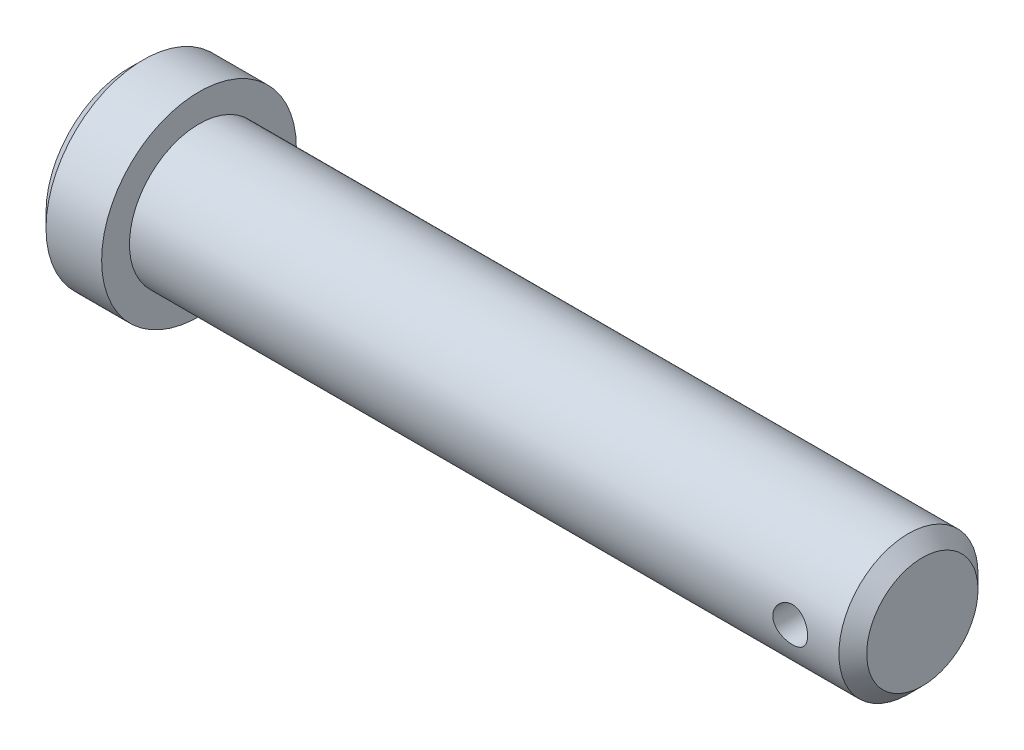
ISO-10303-21;
HEADER;
FILE_DESCRIPTION(('STEP AP214'),'2;1');
FILE_NAME('part.step','',(''),(''),'','','');
FILE_SCHEMA(('AUTOMOTIVE_DESIGN { 1 0 10303 214 1 1 1 1 }'));
ENDSEC;
DATA;
#1=APPLICATION_CONTEXT('core data for automotive mechanical design processes');
#2=APPLICATION_PROTOCOL_DEFINITION('international standard','automotive_design',2000,#1);
#3=PRODUCT_CONTEXT('',#1,'mechanical');
#4=PRODUCT('Part','Part','',(#3));
#5=PRODUCT_RELATED_PRODUCT_CATEGORY('part','',(#4));
#6=PRODUCT_DEFINITION_FORMATION('','',#4);
#7=PRODUCT_DEFINITION_CONTEXT('part definition',#1,'design');
#8=PRODUCT_DEFINITION('design','',#6,#7);
#9=PRODUCT_DEFINITION_SHAPE('','',#8);
#10=(LENGTH_UNIT() NAMED_UNIT(*) SI_UNIT(.MILLI.,.METRE.));
#11=(NAMED_UNIT(*) PLANE_ANGLE_UNIT() SI_UNIT($,.RADIAN.));
#12=(NAMED_UNIT(*) SI_UNIT($,.STERADIAN.) SOLID_ANGLE_UNIT());
#13=UNCERTAINTY_MEASURE_WITH_UNIT(LENGTH_MEASURE(1.E-05),#10,'distance_accuracy_value','');
#14=(GEOMETRIC_REPRESENTATION_CONTEXT(3) GLOBAL_UNCERTAINTY_ASSIGNED_CONTEXT((#13)) GLOBAL_UNIT_ASSIGNED_CONTEXT((#10,
#11,#12)) REPRESENTATION_CONTEXT('',''));
#15=CARTESIAN_POINT('',(0.,0.,0.));
#16=DIRECTION('',(0.,0.,1.));
#17=DIRECTION('',(1.,0.,0.));
#18=AXIS2_PLACEMENT_3D('',#15,#16,#17);
#19=CARTESIAN_POINT('',(0.,0.,0.));
#20=DIRECTION('',(-1.00000000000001,0.,0.));
#21=DIRECTION('',(0.,0.,1.00000000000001));
#22=AXIS2_PLACEMENT_3D('',#19,#20,#21);
#23=PLANE('',#22);
#24=CARTESIAN_POINT('',(0.,0.,0.));
#25=DIRECTION('',(-1.00000000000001,0.,0.));
#26=DIRECTION('',(0.,0.,1.00000000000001));
#27=AXIS2_PLACEMENT_3D('',#24,#25,#26);
#28=CIRCLE('',#27,5.99999999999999);
#29=CARTESIAN_POINT('',(0.,0.,6.00000000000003));
#30=VERTEX_POINT('',#29);
#31=EDGE_CURVE('E45',#30,#30,#28,.T.);
#32=ORIENTED_EDGE('',*,*,#31,.T.);
#33=EDGE_LOOP('',(#32));
#34=FACE_BOUND('',#33,.T.);
#35=ADVANCED_FACE('F34',(#34),#23,.T.);
#36=CARTESIAN_POINT('',(57.0000000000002,0.,1.66533453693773E-13));
#37=DIRECTION('',(1.00000000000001,0.,0.));
#38=DIRECTION('',(0.,0.,-1.00000000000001));
#39=AXIS2_PLACEMENT_3D('',#36,#37,#38);
#40=CYLINDRICAL_SURFACE('',#39,7.);
#41=CARTESIAN_POINT('',(0.999999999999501,-7.105427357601E-12,-1.38777878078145E-12));
#42=DIRECTION('',(-1.00000000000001,0.,0.));
#43=DIRECTION('',(0.,0.,1.00000000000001));
#44=AXIS2_PLACEMENT_3D('',#41,#42,#43);
#45=CIRCLE('',#44,7.);
#46=CARTESIAN_POINT('',(0.999999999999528,-7.06928959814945E-12,6.99999999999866));
#47=VERTEX_POINT('',#46);
#48=EDGE_CURVE('E49',#47,#47,#45,.F.);
#49=ORIENTED_EDGE('',*,*,#48,.T.);
#50=EDGE_LOOP('',(#49));
#51=FACE_BOUND('',#50,.T.);
#52=CARTESIAN_POINT('',(5.00000000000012,0.,6.10622663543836E-13));
#53=DIRECTION('',(1.00000000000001,0.,0.));
#54=DIRECTION('',(0.,0.,-1.00000000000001));
#55=AXIS2_PLACEMENT_3D('',#52,#53,#54);
#56=CIRCLE('',#55,7.);
#57=CARTESIAN_POINT('',(5.00000000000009,0.,-6.99999999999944));
#58=VERTEX_POINT('',#57);
#59=EDGE_CURVE('E54',#58,#58,#56,.T.);
#60=ORIENTED_EDGE('',*,*,#59,.F.);
#61=EDGE_LOOP('',(#60));
#62=FACE_BOUND('',#61,.T.);
#63=ADVANCED_FACE('F84',(#51,#62),#40,.T.);
#64=CARTESIAN_POINT('',(4.99999999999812,6.99999999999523,-1.99840144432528E-12));
#65=DIRECTION('',(1.00000000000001,0.,0.));
#66=DIRECTION('',(0.,0.,-1.00000000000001));
#67=AXIS2_PLACEMENT_3D('',#64,#65,#66);
#68=PLANE('',#67);
#69=ORIENTED_EDGE('',*,*,#59,.T.);
#70=EDGE_LOOP('',(#69));
#71=FACE_BOUND('',#70,.T.);
#72=CARTESIAN_POINT('',(5.00000000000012,0.,6.10622663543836E-13));
#73=DIRECTION('',(1.00000000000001,0.,0.));
#74=DIRECTION('',(0.,0.,-1.00000000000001));
#75=AXIS2_PLACEMENT_3D('',#72,#73,#74);
#76=CIRCLE('',#75,5.);
#77=CARTESIAN_POINT('',(5.0000000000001,0.,-4.99999999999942));
#78=VERTEX_POINT('',#77);
#79=EDGE_CURVE('E62',#78,#78,#76,.T.);
#80=ORIENTED_EDGE('',*,*,#79,.F.);
#81=EDGE_LOOP('',(#80));
#82=FACE_BOUND('',#81,.T.);
#83=ADVANCED_FACE('F82',(#71,#82),#68,.T.);
#84=CARTESIAN_POINT('',(57.0000000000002,0.,1.66533453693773E-13));
#85=DIRECTION('',(1.00000000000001,0.,0.));
#86=DIRECTION('',(0.,0.,-1.00000000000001));
#87=AXIS2_PLACEMENT_3D('',#84,#85,#86);
#88=CYLINDRICAL_SURFACE('',#87,5.);
#89=CARTESIAN_POINT('',(55.9999999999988,-1.24344978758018E-11,-2.66453525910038E-12));
#90=DIRECTION('',(1.00000000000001,0.,0.));
#91=DIRECTION('',(0.,0.,-1.00000000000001));
#92=AXIS2_PLACEMENT_3D('',#89,#90,#91);
#93=CIRCLE('',#92,5.);
#94=CARTESIAN_POINT('',(55.9999999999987,-1.24603105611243E-11,-5.0000000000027));
#95=VERTEX_POINT('',#94);
#96=EDGE_CURVE('E10',#95,#95,#93,.F.);
#97=ORIENTED_EDGE('',*,*,#96,.T.);
#98=EDGE_LOOP('',(#97));
#99=FACE_BOUND('',#98,.T.);
#100=CARTESIAN_POINT('',(51.2499999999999,-3.10862446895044E-12,-4.99999999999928));
#101=CARTESIAN_POINT('',(51.2500019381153,0.0690634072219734,-4.99999883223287));
#102=CARTESIAN_POINT('',(51.2557429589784,0.138148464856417,-4.99855481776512));
#103=CARTESIAN_POINT('',(51.2785209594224,0.274338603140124,-4.99293428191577));
#104=CARTESIAN_POINT('',(51.295564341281,0.341442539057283,-4.98875621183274));
#105=CARTESIAN_POINT('',(51.3403660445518,0.471684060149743,-4.97813021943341));
#106=CARTESIAN_POINT('',(51.3681114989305,0.534826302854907,-4.97168502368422));
#107=CARTESIAN_POINT('',(51.4334844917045,0.655560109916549,-4.95721119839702));
#108=CARTESIAN_POINT('',(51.4711123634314,0.713151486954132,-4.94918251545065));
#109=CARTESIAN_POINT('',(51.5560006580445,0.822334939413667,-4.93222844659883));
#110=CARTESIAN_POINT('',(51.6034263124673,0.87379640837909,-4.9232892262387));
#111=CARTESIAN_POINT('',(51.706210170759,0.968124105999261,-4.90561350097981));
#112=CARTESIAN_POINT('',(51.7615692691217,1.01098936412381,-4.896877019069));
#113=CARTESIAN_POINT('',(51.8796626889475,1.08752211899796,-4.88045646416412));
#114=CARTESIAN_POINT('',(51.9424943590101,1.1210435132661,-4.872789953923));
#115=CARTESIAN_POINT('',(52.0731236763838,1.17699742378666,-4.85957912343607));
#116=CARTESIAN_POINT('',(52.1409205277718,1.19943171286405,-4.85403446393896));
#117=CARTESIAN_POINT('',(52.2781195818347,1.23212903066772,-4.845837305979));
#118=CARTESIAN_POINT('',(52.3474624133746,1.24262689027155,-4.84312909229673));
#119=CARTESIAN_POINT('',(52.4869738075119,1.25188481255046,-4.84074468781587));
#120=CARTESIAN_POINT('',(52.5571422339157,1.25064678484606,-4.8410680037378));
#121=CARTESIAN_POINT('',(52.69451317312,1.23665543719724,-4.84466004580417));
#122=CARTESIAN_POINT('',(52.7617463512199,1.22418195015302,-4.84785719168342));
#123=CARTESIAN_POINT('',(52.8931342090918,1.18852015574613,-4.856722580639));
#124=CARTESIAN_POINT('',(52.9572886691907,1.16533108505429,-4.8623909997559));
#125=CARTESIAN_POINT('',(53.0814483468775,1.10865789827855,-4.87562594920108));
#126=CARTESIAN_POINT('',(53.1414051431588,1.07507222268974,-4.88321106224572));
#127=CARTESIAN_POINT('',(53.2549322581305,0.998630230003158,-4.89941425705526));
#128=CARTESIAN_POINT('',(53.3085014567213,0.955772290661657,-4.90803251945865));
#129=CARTESIAN_POINT('',(53.4093363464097,0.860552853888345,-4.92563233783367));
#130=CARTESIAN_POINT('',(53.4563787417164,0.807955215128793,-4.93461724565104));
#131=CARTESIAN_POINT('',(53.5410177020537,0.695509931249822,-4.95171637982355));
#132=CARTESIAN_POINT('',(53.5786139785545,0.635662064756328,-4.95983057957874));
#133=CARTESIAN_POINT('',(53.6433754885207,0.510096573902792,-4.97431443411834));
#134=CARTESIAN_POINT('',(53.6705044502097,0.444359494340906,-4.98067800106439));
#135=CARTESIAN_POINT('',(53.7132644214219,0.309063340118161,-4.99089930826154));
#136=CARTESIAN_POINT('',(53.7288976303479,0.23950499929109,-4.99475752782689));
#137=CARTESIAN_POINT('',(53.747881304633,0.100449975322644,-4.99946249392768));
#138=CARTESIAN_POINT('',(53.7515358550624,0.0309972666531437,-5.00038377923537));
#139=CARTESIAN_POINT('',(53.7472924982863,-0.107527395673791,-4.99932337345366));
#140=CARTESIAN_POINT('',(53.7393956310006,-0.176599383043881,-4.997341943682));
#141=CARTESIAN_POINT('',(53.7125242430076,-0.311345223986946,-4.99074650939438));
#142=CARTESIAN_POINT('',(53.6937156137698,-0.377054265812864,-4.98617195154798));
#143=CARTESIAN_POINT('',(53.6457440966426,-0.50438107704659,-4.97490588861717));
#144=CARTESIAN_POINT('',(53.6165801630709,-0.565998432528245,-4.9682141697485));
#145=CARTESIAN_POINT('',(53.5481365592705,-0.684602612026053,-4.95327756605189));
#146=CARTESIAN_POINT('',(53.5086865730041,-0.741487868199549,-4.94500722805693));
#147=CARTESIAN_POINT('',(53.4210084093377,-0.847938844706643,-4.92787090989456));
#148=CARTESIAN_POINT('',(53.3727787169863,-0.897503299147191,-4.91900482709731));
#149=CARTESIAN_POINT('',(53.2674983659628,-0.989158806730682,-4.90140797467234));
#150=CARTESIAN_POINT('',(53.2102602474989,-1.03103655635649,-4.89268586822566));
#151=CARTESIAN_POINT('',(53.0893894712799,-1.10459229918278,-4.87660731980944));
#152=CARTESIAN_POINT('',(53.0257570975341,-1.13627074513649,-4.86925081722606));
#153=CARTESIAN_POINT('',(52.8942452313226,-1.18829285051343,-4.85681745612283));
#154=CARTESIAN_POINT('',(52.8263936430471,-1.20870366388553,-4.85172712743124));
#155=CARTESIAN_POINT('',(52.6880753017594,-1.23778804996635,-4.84438953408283));
#156=CARTESIAN_POINT('',(52.6176091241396,-1.2464641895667,-4.84214164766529));
#157=CARTESIAN_POINT('',(52.4782324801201,-1.25169882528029,-4.8407908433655));
#158=CARTESIAN_POINT('',(52.4093354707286,-1.24859824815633,-4.84159943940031));
#159=CARTESIAN_POINT('',(52.2730800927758,-1.23114773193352,-4.84606590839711));
#160=CARTESIAN_POINT('',(52.2057216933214,-1.21679801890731,-4.84972372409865));
#161=CARTESIAN_POINT('',(52.0748262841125,-1.17744276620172,-4.85942717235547));
#162=CARTESIAN_POINT('',(52.0112689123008,-1.15250117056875,-4.86545846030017));
#163=CARTESIAN_POINT('',(51.8891955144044,-1.09272076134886,-4.879231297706));
#164=CARTESIAN_POINT('',(51.8306801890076,-1.05788057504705,-4.88697308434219));
#165=CARTESIAN_POINT('',(51.7187044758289,-0.978223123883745,-4.90354695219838));
#166=CARTESIAN_POINT('',(51.6654157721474,-0.933169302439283,-4.91240220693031));
#167=CARTESIAN_POINT('',(51.56704412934,-0.834824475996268,-4.93006689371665));
#168=CARTESIAN_POINT('',(51.5219631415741,-0.781531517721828,-4.93887631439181));
#169=CARTESIAN_POINT('',(51.4404905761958,-0.667056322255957,-4.95564713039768));
#170=CARTESIAN_POINT('',(51.4042711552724,-0.605748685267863,-4.96359027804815));
#171=CARTESIAN_POINT('',(51.3427104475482,-0.477721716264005,-4.97754104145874));
#172=CARTESIAN_POINT('',(51.3173613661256,-0.411006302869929,-4.98355004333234));
#173=CARTESIAN_POINT('',(51.2820234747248,-0.287008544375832,-4.99206716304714));
#174=CARTESIAN_POINT('',(51.270040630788,-0.23031680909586,-4.99502154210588));
#175=CARTESIAN_POINT('',(51.2540283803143,-0.115755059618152,-4.99898837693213));
#176=CARTESIAN_POINT('',(51.2499983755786,-0.0578851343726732,-5.0000009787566));
#177=CARTESIAN_POINT('',(51.2499999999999,-3.10862446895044E-12,-4.99999999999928));
#178=B_SPLINE_CURVE_WITH_KNOTS('',3,(#100,#101,#102,#103,#104,#105,#106,#107,#108,#109,#110,
#111,#112,#113,#114,#115,#116,#117,#118,#119,#120,#121,#122,#123,#124,#125,#126,#127,#128,#129,
#130,#131,#132,#133,#134,#135,#136,#137,#138,#139,#140,#141,#142,#143,#144,#145,#146,#147,#148,
#149,#150,#151,#152,#153,#154,#155,#156,#157,#158,#159,#160,#161,#162,#163,#164,#165,#166,#167,
#168,#169,#170,#171,#172,#173,#174,#175,#176,#177),.UNSPECIFIED.,.T.,.F.,(4,2,2,2,2,2,2,2,2,2,2,
2,2,2,2,2,2,2,2,2,2,2,2,2,2,2,2,2,2,2,2,2,2,2,2,2,2,2,4),(0.,0.206978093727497,
0.414073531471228,0.620920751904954,0.827774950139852,1.0384536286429,1.249156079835,
1.46298872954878,1.67678717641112,1.88630245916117,2.09578365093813,2.30018747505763,
2.50460586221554,2.71108773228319,2.91760575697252,3.13001250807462,3.34242574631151,
3.55556857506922,3.76867061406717,3.97631924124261,4.18394917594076,4.38850228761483,
4.5930760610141,4.80127989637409,5.0095196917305,5.22287091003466,5.4362126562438,
5.64826878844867,5.8602785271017,6.0661981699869,6.27211367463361,6.47680333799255,
6.68152140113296,6.89157980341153,7.10168808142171,7.31560154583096,7.52936136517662,
7.702852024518,7.87632963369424),.UNSPECIFIED.);
#179=CARTESIAN_POINT('',(51.2499999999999,-3.10862446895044E-12,-4.99999999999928));
#180=VERTEX_POINT('',#179);
#181=EDGE_CURVE('E55',#180,#180,#178,.T.);
#182=ORIENTED_EDGE('',*,*,#181,.F.);
#183=EDGE_LOOP('',(#182));
#184=FACE_BOUND('',#183,.T.);
#185=CARTESIAN_POINT('',(53.7499999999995,0.,5.0000000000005));
#186=CARTESIAN_POINT('',(53.7499980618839,0.0690634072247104,4.99999883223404));
#187=CARTESIAN_POINT('',(53.74425704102,0.138148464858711,4.99855481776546));
#188=CARTESIAN_POINT('',(53.7214790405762,0.27433860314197,4.99293428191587));
#189=CARTESIAN_POINT('',(53.7044356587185,0.341442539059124,4.98875621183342));
#190=CARTESIAN_POINT('',(53.6596339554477,0.471684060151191,4.97813021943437));
#191=CARTESIAN_POINT('',(53.6318885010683,0.534826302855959,4.97168502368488));
#192=CARTESIAN_POINT('',(53.5665155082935,0.65556010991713,4.95721119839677));
#193=CARTESIAN_POINT('',(53.5288876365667,0.713151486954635,4.9491825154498));
#194=CARTESIAN_POINT('',(53.4439993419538,0.822334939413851,4.93222844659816));
#195=CARTESIAN_POINT('',(53.396573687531,0.873796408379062,4.92328922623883));
#196=CARTESIAN_POINT('',(53.2937898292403,0.96812410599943,4.90561350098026));
#197=CARTESIAN_POINT('',(53.2384307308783,1.0109893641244,4.89687701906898));
#198=CARTESIAN_POINT('',(53.120337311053,1.08752211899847,4.88045646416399));
#199=CARTESIAN_POINT('',(53.0575056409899,1.12104351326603,4.87278995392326));
#200=CARTESIAN_POINT('',(52.9268763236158,1.17699742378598,4.8595791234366));
#201=CARTESIAN_POINT('',(52.8590794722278,1.19943171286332,4.85403446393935));
#202=CARTESIAN_POINT('',(52.7218804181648,1.23212903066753,4.84583730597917));
#203=CARTESIAN_POINT('',(52.6525375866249,1.24262689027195,4.84312909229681));
#204=CARTESIAN_POINT('',(52.5130261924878,1.25188481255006,4.84074468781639));
#205=CARTESIAN_POINT('',(52.4428577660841,1.2506467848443,4.84106800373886));
#206=CARTESIAN_POINT('',(52.3054868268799,1.23665543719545,4.84466004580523));
#207=CARTESIAN_POINT('',(52.23825364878,1.2241819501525,4.84785719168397));
#208=CARTESIAN_POINT('',(52.1068657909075,1.18852015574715,4.85672258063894));
#209=CARTESIAN_POINT('',(52.0427113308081,1.16533108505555,4.86239099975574));
#210=CARTESIAN_POINT('',(51.918551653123,1.10865789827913,4.87562594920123));
#211=CARTESIAN_POINT('',(51.8585948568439,1.07507222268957,4.88321106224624));
#212=CARTESIAN_POINT('',(51.7450677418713,0.998630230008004,4.89941425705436));
#213=CARTESIAN_POINT('',(51.6914985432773,0.955772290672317,4.90803251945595));
#214=CARTESIAN_POINT('',(51.590663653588,0.860552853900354,4.92563233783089));
#215=CARTESIAN_POINT('',(51.5436212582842,0.807955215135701,4.93461724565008));
#216=CARTESIAN_POINT('',(51.4589822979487,0.695509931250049,4.95171637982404));
#217=CARTESIAN_POINT('',(51.4213860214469,0.635662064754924,4.95983057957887));
#218=CARTESIAN_POINT('',(51.3566245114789,0.510096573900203,4.97431443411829));
#219=CARTESIAN_POINT('',(51.3294955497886,0.444359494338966,4.98067800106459));
#220=CARTESIAN_POINT('',(51.2867355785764,0.309063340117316,4.99089930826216));
#221=CARTESIAN_POINT('',(51.2711023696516,0.239504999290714,4.99475752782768));
#222=CARTESIAN_POINT('',(51.2521186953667,0.100449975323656,4.99946249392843));
#223=CARTESIAN_POINT('',(51.2484641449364,0.0309972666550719,5.00038377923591));
#224=CARTESIAN_POINT('',(51.2527075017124,-0.107527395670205,4.99932337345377));
#225=CARTESIAN_POINT('',(51.260604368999,-0.176599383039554,4.99734194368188));
#226=CARTESIAN_POINT('',(51.2874757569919,-0.311345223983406,4.99074650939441));
#227=CARTESIAN_POINT('',(51.3062843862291,-0.377054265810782,4.98617195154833));
#228=CARTESIAN_POINT('',(51.3542559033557,-0.504381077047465,4.97490588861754));
#229=CARTESIAN_POINT('',(51.3834198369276,-0.565998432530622,4.96821416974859));
#230=CARTESIAN_POINT('',(51.4518634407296,-0.684602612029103,4.95327756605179));
#231=CARTESIAN_POINT('',(51.4913134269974,-0.741487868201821,4.94500722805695));
#232=CARTESIAN_POINT('',(51.5789915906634,-0.847938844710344,4.9278709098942));
#233=CARTESIAN_POINT('',(51.627221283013,-0.897503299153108,4.91900482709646));
#234=CARTESIAN_POINT('',(51.7325016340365,-0.989158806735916,4.90140797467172));
#235=CARTESIAN_POINT('',(51.7897397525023,-1.03103655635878,4.89268586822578));
#236=CARTESIAN_POINT('',(51.910610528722,-1.10459229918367,4.87660731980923));
#237=CARTESIAN_POINT('',(51.9742429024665,-1.1362707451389,4.86925081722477));
#238=CARTESIAN_POINT('',(52.1057547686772,-1.18829285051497,4.8568174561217));
#239=CARTESIAN_POINT('',(52.1736063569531,-1.20870366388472,4.85172712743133));
#240=CARTESIAN_POINT('',(52.3119246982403,-1.23778804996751,4.84438953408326));
#241=CARTESIAN_POINT('',(52.3823908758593,-1.24646418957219,4.84214164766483));
#242=CARTESIAN_POINT('',(52.5217675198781,-1.25169882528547,4.84079084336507));
#243=CARTESIAN_POINT('',(52.5906645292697,-1.24859824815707,4.84159943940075));
#244=CARTESIAN_POINT('',(52.7269199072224,-1.23114773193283,4.84606590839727));
#245=CARTESIAN_POINT('',(52.7942783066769,-1.21679801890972,4.84972372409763));
#246=CARTESIAN_POINT('',(52.9251737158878,-1.17744276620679,4.85942717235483));
#247=CARTESIAN_POINT('',(52.9887310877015,-1.15250117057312,4.86545846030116));
#248=CARTESIAN_POINT('',(53.1108044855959,-1.09272076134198,4.8792312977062));
#249=CARTESIAN_POINT('',(53.1693198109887,-1.05788057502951,4.88697308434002));
#250=CARTESIAN_POINT('',(53.2812955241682,-0.978223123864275,4.90354695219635));
#251=CARTESIAN_POINT('',(53.334584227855,-0.933169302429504,4.91240220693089));
#252=CARTESIAN_POINT('',(53.4329558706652,-0.834824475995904,4.9300668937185));
#253=CARTESIAN_POINT('',(53.4780368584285,-0.781531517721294,4.93887631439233));
#254=CARTESIAN_POINT('',(53.5595094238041,-0.66705632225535,4.95564713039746));
#255=CARTESIAN_POINT('',(53.595728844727,-0.605748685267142,4.96359027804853));
#256=CARTESIAN_POINT('',(53.6572895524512,-0.477721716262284,4.97754104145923));
#257=CARTESIAN_POINT('',(53.6826386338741,-0.411006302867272,4.98355004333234));
#258=CARTESIAN_POINT('',(53.7179765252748,-0.287008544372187,4.992067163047));
#259=CARTESIAN_POINT('',(53.7299593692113,-0.230316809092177,4.99502154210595));
#260=CARTESIAN_POINT('',(53.745971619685,-0.115755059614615,4.99898837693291));
#261=CARTESIAN_POINT('',(53.750001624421,-0.057885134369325,5.00000097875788));
#262=CARTESIAN_POINT('',(53.7499999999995,0.,5.0000000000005));
#263=B_SPLINE_CURVE_WITH_KNOTS('',3,(#185,#186,#187,#188,#189,#190,#191,#192,#193,#194,#195,
#196,#197,#198,#199,#200,#201,#202,#203,#204,#205,#206,#207,#208,#209,#210,#211,#212,#213,#214,
#215,#216,#217,#218,#219,#220,#221,#222,#223,#224,#225,#226,#227,#228,#229,#230,#231,#232,#233,
#234,#235,#236,#237,#238,#239,#240,#241,#242,#243,#244,#245,#246,#247,#248,#249,#250,#251,#252,
#253,#254,#255,#256,#257,#258,#259,#260,#261,#262),.UNSPECIFIED.,.T.,.F.,(4,2,2,2,2,2,2,2,2,2,2,
2,2,2,2,2,2,2,2,2,2,2,2,2,2,2,2,2,2,2,2,2,2,2,2,2,2,2,4),(0.,0.206978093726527,
0.414073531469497,0.620920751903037,0.827774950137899,1.03845362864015,1.2491560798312,
1.46298872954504,1.67678717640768,1.88630245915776,2.09578365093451,2.30018747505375,
2.50460586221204,2.71108773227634,2.91760575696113,3.13001250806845,3.34242574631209,
3.55556857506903,3.76867061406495,3.97631924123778,4.18394917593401,4.38850228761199,
4.59307606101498,4.80127989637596,5.00951969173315,5.22287091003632,5.43621265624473,
5.64826878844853,5.86027852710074,6.06619816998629,6.272113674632,6.47680333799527,
6.68152140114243,6.8915798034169,7.10168808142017,7.31560154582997,7.52936136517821,
7.70285202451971,7.87632963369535),.UNSPECIFIED.);
#264=CARTESIAN_POINT('',(53.7499999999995,0.,5.0000000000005));
#265=VERTEX_POINT('',#264);
#266=EDGE_CURVE('E63',#265,#265,#263,.T.);
#267=ORIENTED_EDGE('',*,*,#266,.F.);
#268=EDGE_LOOP('',(#267));
#269=FACE_BOUND('',#268,.T.);
#270=ORIENTED_EDGE('',*,*,#79,.T.);
#271=EDGE_LOOP('',(#270));
#272=FACE_BOUND('',#271,.T.);
#273=ADVANCED_FACE('F67',(#99,#184,#269,#272),#88,.T.);
#274=CARTESIAN_POINT('',(56.9999999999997,4.99999999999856,6.66133814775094E-13));
#275=DIRECTION('',(1.00000000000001,0.,0.));
#276=DIRECTION('',(0.,0.,-1.00000000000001));
#277=AXIS2_PLACEMENT_3D('',#274,#275,#276);
#278=PLANE('',#277);
#279=CARTESIAN_POINT('',(57.0000000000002,0.,1.66533453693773E-13));
#280=DIRECTION('',(1.00000000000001,0.,0.));
#281=DIRECTION('',(0.,0.,-1.00000000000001));
#282=AXIS2_PLACEMENT_3D('',#279,#280,#281);
#283=CIRCLE('',#282,4.);
#284=CARTESIAN_POINT('',(57.0000000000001,0.,-3.99999999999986));
#285=VERTEX_POINT('',#284);
#286=EDGE_CURVE('E41',#285,#285,#283,.T.);
#287=ORIENTED_EDGE('',*,*,#286,.T.);
#288=EDGE_LOOP('',(#287));
#289=FACE_BOUND('',#288,.T.);
#290=ADVANCED_FACE('F75',(#289),#278,.T.);
#291=CARTESIAN_POINT('',(52.4999999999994,-6.21724893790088E-12,-6.99999999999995));
#292=DIRECTION('',(0.,0.,1.00000000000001));
#293=DIRECTION('',(1.00000000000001,0.,0.));
#294=AXIS2_PLACEMENT_3D('',#291,#292,#293);
#295=CYLINDRICAL_SURFACE('',#294,1.25);
#296=ORIENTED_EDGE('',*,*,#181,.T.);
#297=EDGE_LOOP('',(#296));
#298=FACE_BOUND('',#297,.T.);
#299=ORIENTED_EDGE('',*,*,#266,.T.);
#300=EDGE_LOOP('',(#299));
#301=FACE_BOUND('',#300,.T.);
#302=ADVANCED_FACE('F71',(#298,#301),#295,.F.);
#303=CARTESIAN_POINT('',(0.999999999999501,-7.105427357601E-12,-1.38777878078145E-12));
#304=DIRECTION('',(1.00000000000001,0.,0.));
#305=DIRECTION('',(0.,0.,-1.00000000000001));
#306=AXIS2_PLACEMENT_3D('',#303,#304,#305);
#307=CONICAL_SURFACE('',#306,7.,0.785398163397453);
#308=ORIENTED_EDGE('',*,*,#31,.F.);
#309=EDGE_LOOP('',(#308));
#310=FACE_BOUND('',#309,.T.);
#311=ORIENTED_EDGE('',*,*,#48,.F.);
#312=EDGE_LOOP('',(#311));
#313=FACE_BOUND('',#312,.T.);
#314=ADVANCED_FACE('F74',(#310,#313),#307,.T.);
#315=CARTESIAN_POINT('',(57.0000000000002,0.,1.66533453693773E-13));
#316=DIRECTION('',(-1.00000000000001,0.,0.));
#317=DIRECTION('',(0.,0.,1.00000000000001));
#318=AXIS2_PLACEMENT_3D('',#315,#316,#317);
#319=CONICAL_SURFACE('',#318,4.,0.785398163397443);
#320=ORIENTED_EDGE('',*,*,#96,.F.);
#321=EDGE_LOOP('',(#320));
#322=FACE_BOUND('',#321,.T.);
#323=ORIENTED_EDGE('',*,*,#286,.F.);
#324=EDGE_LOOP('',(#323));
#325=FACE_BOUND('',#324,.T.);
#326=ADVANCED_FACE('F36',(#322,#325),#319,.T.);
#327=CLOSED_SHELL('',(#35,#63,#83,#273,#290,#302,#314,#326));
#328=MANIFOLD_SOLID_BREP('B2',#327);
#329=ADVANCED_BREP_SHAPE_REPRESENTATION('',(#18,#328),#14);
#330=SHAPE_DEFINITION_REPRESENTATION(#9,#329);
ENDSEC;
END-ISO-10303-21;
